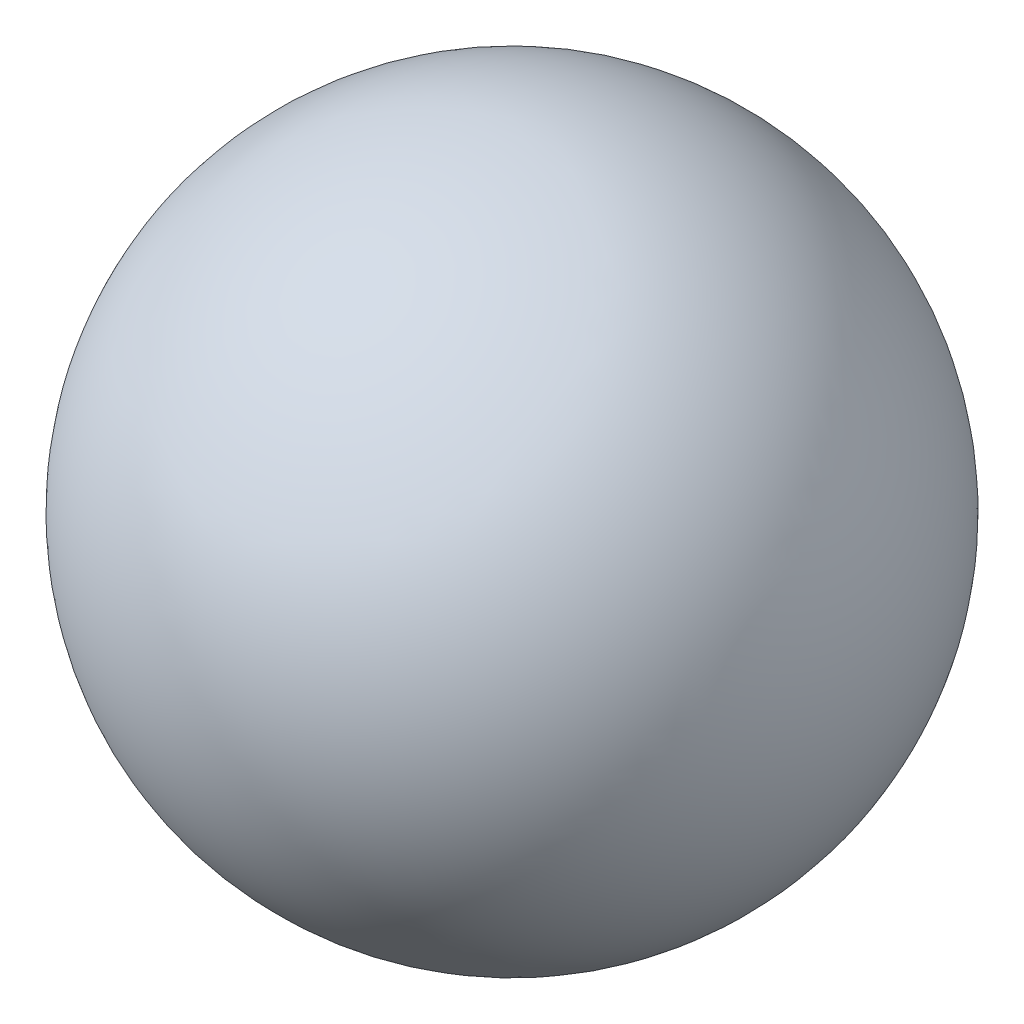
from build123d import *


with BuildPart() as part:
    # Esquisse1 → Base-R_volution (revolve)
    with BuildSketch(Plane(origin=(0, 0, 0), x_dir=(1, 0, 0), z_dir=(0, 1, 0))):
        with BuildLine():
            Line((0.45, 1.35), (2.25, 1.35))
            ThreePointArc((2.25, 1.35), (1.35, 2.25), (0.45, 1.35))
        make_face()
    revolve(axis=Axis((-0.15, 0, -1.35), (1, 0, 0)))


solid = part.part
